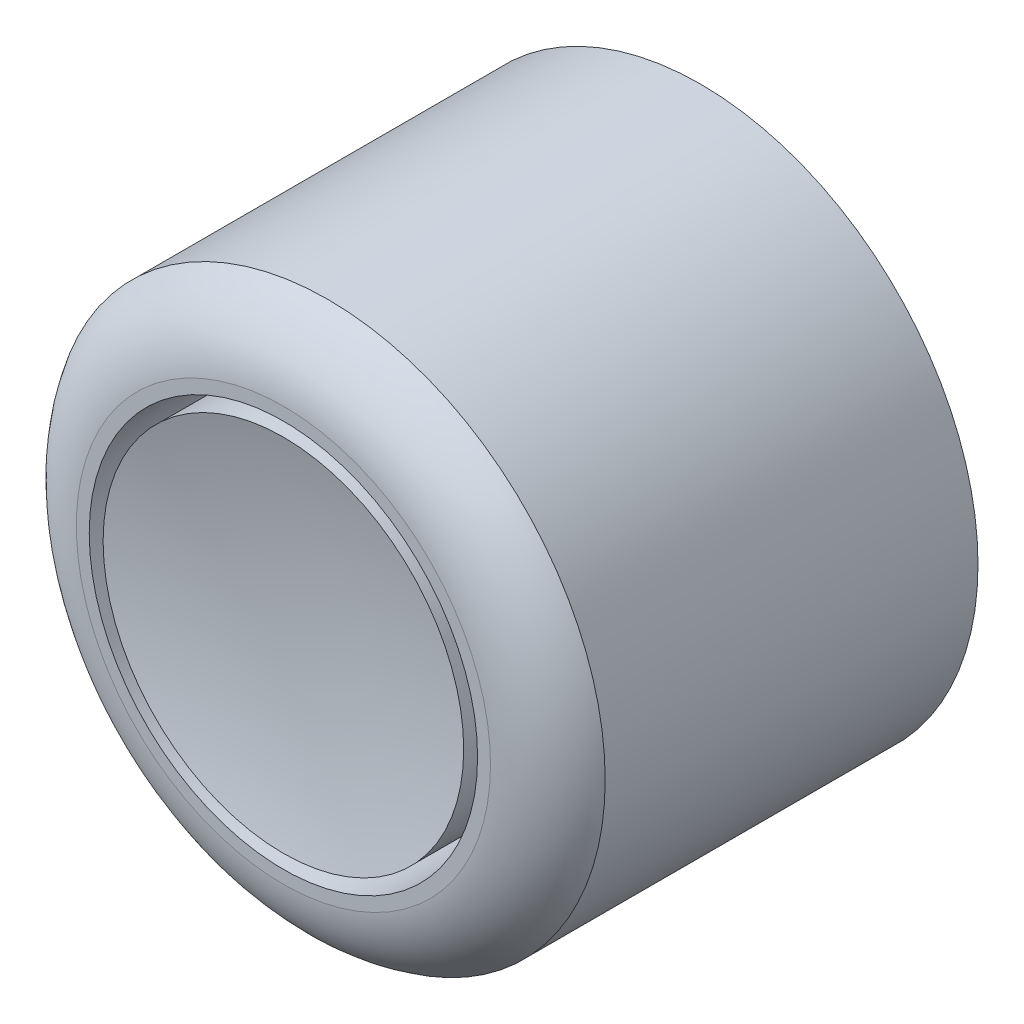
ISO-10303-21;
HEADER;
FILE_DESCRIPTION(('STEP AP214'),'2;1');
FILE_NAME('part.step','',(''),(''),'','','');
FILE_SCHEMA(('AUTOMOTIVE_DESIGN { 1 0 10303 214 1 1 1 1 }'));
ENDSEC;
DATA;
#1=APPLICATION_CONTEXT('core data for automotive mechanical design processes');
#2=APPLICATION_PROTOCOL_DEFINITION('international standard','automotive_design',2000,#1);
#3=PRODUCT_CONTEXT('',#1,'mechanical');
#4=PRODUCT('Part','Part','',(#3));
#5=PRODUCT_RELATED_PRODUCT_CATEGORY('part','',(#4));
#6=PRODUCT_DEFINITION_FORMATION('','',#4);
#7=PRODUCT_DEFINITION_CONTEXT('part definition',#1,'design');
#8=PRODUCT_DEFINITION('design','',#6,#7);
#9=PRODUCT_DEFINITION_SHAPE('','',#8);
#10=(LENGTH_UNIT() NAMED_UNIT(*) SI_UNIT(.MILLI.,.METRE.));
#11=(NAMED_UNIT(*) PLANE_ANGLE_UNIT() SI_UNIT($,.RADIAN.));
#12=(NAMED_UNIT(*) SI_UNIT($,.STERADIAN.) SOLID_ANGLE_UNIT());
#13=UNCERTAINTY_MEASURE_WITH_UNIT(LENGTH_MEASURE(1.E-05),#10,'distance_accuracy_value','');
#14=(GEOMETRIC_REPRESENTATION_CONTEXT(3) GLOBAL_UNCERTAINTY_ASSIGNED_CONTEXT((#13)) GLOBAL_UNIT_ASSIGNED_CONTEXT((#10,
#11,#12)) REPRESENTATION_CONTEXT('',''));
#15=CARTESIAN_POINT('',(0.,0.,0.));
#16=DIRECTION('',(0.,0.,1.));
#17=DIRECTION('',(1.,0.,0.));
#18=AXIS2_PLACEMENT_3D('',#15,#16,#17);
#19=CARTESIAN_POINT('',(0.,0.,-5.04293524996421));
#20=DIRECTION('',(0.,0.,1.));
#21=DIRECTION('',(1.,0.,0.));
#22=AXIS2_PLACEMENT_3D('',#19,#20,#21);
#23=TOROIDAL_SURFACE('',#22,11.4815178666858,5.05641870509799);
#24=CARTESIAN_POINT('',(0.,0.,-2.54));
#25=DIRECTION('',(0.,0.,1.));
#26=DIRECTION('',(1.,0.,0.));
#27=AXIS2_PLACEMENT_3D('',#24,#25,#26);
#28=CIRCLE('',#27,15.875);
#29=CARTESIAN_POINT('',(15.875,0.,-2.54));
#30=VERTEX_POINT('',#29);
#31=EDGE_CURVE('E55',#30,#30,#28,.T.);
#32=ORIENTED_EDGE('',*,*,#31,.T.);
#33=EDGE_LOOP('',(#32));
#34=FACE_BOUND('',#33,.T.);
#35=CARTESIAN_POINT('',(0.,0.,0.));
#36=DIRECTION('',(0.,0.,1.));
#37=DIRECTION('',(1.,0.,0.));
#38=AXIS2_PLACEMENT_3D('',#35,#36,#37);
#39=CIRCLE('',#38,11.8505357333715);
#40=CARTESIAN_POINT('',(11.8505357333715,0.,0.));
#41=VERTEX_POINT('',#40);
#42=EDGE_CURVE('E10',#41,#41,#39,.T.);
#43=ORIENTED_EDGE('',*,*,#42,.F.);
#44=EDGE_LOOP('',(#43));
#45=FACE_BOUND('',#44,.T.);
#46=ADVANCED_FACE('F30',(#34,#45),#23,.T.);
#47=CARTESIAN_POINT('',(0.,0.,0.));
#48=DIRECTION('',(0.,0.,-1.));
#49=DIRECTION('',(-1.,0.,0.));
#50=AXIS2_PLACEMENT_3D('',#47,#48,#49);
#51=PLANE('',#50);
#52=CARTESIAN_POINT('',(0.,0.,0.));
#53=DIRECTION('',(0.,0.,1.));
#54=DIRECTION('',(1.,0.,0.));
#55=AXIS2_PLACEMENT_3D('',#52,#53,#54);
#56=CIRCLE('',#55,11.1125);
#57=CARTESIAN_POINT('',(11.1125,0.,0.));
#58=VERTEX_POINT('',#57);
#59=EDGE_CURVE('E36',#58,#58,#56,.T.);
#60=ORIENTED_EDGE('',*,*,#59,.F.);
#61=EDGE_LOOP('',(#60));
#62=FACE_BOUND('',#61,.T.);
#63=ORIENTED_EDGE('',*,*,#42,.T.);
#64=EDGE_LOOP('',(#63));
#65=FACE_BOUND('',#64,.T.);
#66=ADVANCED_FACE('F78',(#62,#65),#51,.F.);
#67=CARTESIAN_POINT('',(0.,0.,0.));
#68=DIRECTION('',(0.,0.,1.));
#69=DIRECTION('',(1.,0.,0.));
#70=AXIS2_PLACEMENT_3D('',#67,#68,#69);
#71=CYLINDRICAL_SURFACE('',#70,11.1125);
#72=CARTESIAN_POINT('',(0.,0.,-12.7));
#73=DIRECTION('',(0.,0.,1.));
#74=DIRECTION('',(1.,0.,0.));
#75=AXIS2_PLACEMENT_3D('',#72,#73,#74);
#76=CIRCLE('',#75,11.1125);
#77=CARTESIAN_POINT('',(11.1125,0.,-12.7));
#78=VERTEX_POINT('',#77);
#79=EDGE_CURVE('E40',#78,#78,#76,.T.);
#80=ORIENTED_EDGE('',*,*,#79,.F.);
#81=EDGE_LOOP('',(#80));
#82=FACE_BOUND('',#81,.T.);
#83=ORIENTED_EDGE('',*,*,#59,.T.);
#84=EDGE_LOOP('',(#83));
#85=FACE_BOUND('',#84,.T.);
#86=ADVANCED_FACE('F82',(#82,#85),#71,.F.);
#87=CARTESIAN_POINT('',(0.,0.,-12.7));
#88=DIRECTION('',(0.,0.,-1.));
#89=DIRECTION('',(-1.,0.,0.));
#90=AXIS2_PLACEMENT_3D('',#87,#88,#89);
#91=PLANE('',#90);
#92=CARTESIAN_POINT('',(0.,0.,-12.7));
#93=DIRECTION('',(0.,0.,1.));
#94=DIRECTION('',(1.,0.,0.));
#95=AXIS2_PLACEMENT_3D('',#92,#93,#94);
#96=CIRCLE('',#95,10.31875);
#97=CARTESIAN_POINT('',(10.31875,0.,-12.7));
#98=VERTEX_POINT('',#97);
#99=EDGE_CURVE('E44',#98,#98,#96,.T.);
#100=ORIENTED_EDGE('',*,*,#99,.F.);
#101=EDGE_LOOP('',(#100));
#102=FACE_BOUND('',#101,.T.);
#103=ORIENTED_EDGE('',*,*,#79,.T.);
#104=EDGE_LOOP('',(#103));
#105=FACE_BOUND('',#104,.T.);
#106=ADVANCED_FACE('F87',(#102,#105),#91,.F.);
#107=CARTESIAN_POINT('',(0.,0.,0.));
#108=DIRECTION('',(0.,0.,1.));
#109=DIRECTION('',(1.,0.,0.));
#110=AXIS2_PLACEMENT_3D('',#107,#108,#109);
#111=CYLINDRICAL_SURFACE('',#110,10.31875);
#112=CARTESIAN_POINT('',(0.,0.,0.));
#113=DIRECTION('',(0.,0.,1.));
#114=DIRECTION('',(1.,0.,0.));
#115=AXIS2_PLACEMENT_3D('',#112,#113,#114);
#116=CIRCLE('',#115,10.31875);
#117=CARTESIAN_POINT('',(10.31875,0.,0.));
#118=VERTEX_POINT('',#117);
#119=EDGE_CURVE('E49',#118,#118,#116,.T.);
#120=ORIENTED_EDGE('',*,*,#119,.F.);
#121=EDGE_LOOP('',(#120));
#122=FACE_BOUND('',#121,.T.);
#123=ORIENTED_EDGE('',*,*,#99,.T.);
#124=EDGE_LOOP('',(#123));
#125=FACE_BOUND('',#124,.T.);
#126=ADVANCED_FACE('F74',(#122,#125),#111,.T.);
#127=CARTESIAN_POINT('',(0.,0.,41.284921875));
#128=DIRECTION('',(0.,0.,1.));
#129=DIRECTION('',(0.,1.,0.));
#130=AXIS2_PLACEMENT_3D('',#127,#128,#129);
#131=SPHERICAL_SURFACE('',#130,42.554921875);
#132=ORIENTED_EDGE('',*,*,#119,.T.);
#133=EDGE_LOOP('',(#132));
#134=FACE_BOUND('',#133,.T.);
#135=ADVANCED_FACE('F69',(#134),#131,.F.);
#136=CARTESIAN_POINT('',(0.,0.,-23.876));
#137=DIRECTION('',(0.,0.,1.));
#138=DIRECTION('',(1.,0.,0.));
#139=AXIS2_PLACEMENT_3D('',#136,#137,#138);
#140=PLANE('',#139);
#141=CARTESIAN_POINT('',(0.,0.,-23.876));
#142=DIRECTION('',(0.,0.,1.));
#143=DIRECTION('',(1.,0.,0.));
#144=AXIS2_PLACEMENT_3D('',#141,#142,#143);
#145=CIRCLE('',#144,15.875);
#146=CARTESIAN_POINT('',(15.875,0.,-23.876));
#147=VERTEX_POINT('',#146);
#148=EDGE_CURVE('E52',#147,#147,#145,.T.);
#149=ORIENTED_EDGE('',*,*,#148,.F.);
#150=EDGE_LOOP('',(#149));
#151=FACE_BOUND('',#150,.T.);
#152=ADVANCED_FACE('F64',(#151),#140,.F.);
#153=CARTESIAN_POINT('',(0.,0.,0.));
#154=DIRECTION('',(0.,0.,1.));
#155=DIRECTION('',(1.,0.,0.));
#156=AXIS2_PLACEMENT_3D('',#153,#154,#155);
#157=CYLINDRICAL_SURFACE('',#156,15.875);
#158=ORIENTED_EDGE('',*,*,#31,.F.);
#159=EDGE_LOOP('',(#158));
#160=FACE_BOUND('',#159,.T.);
#161=ORIENTED_EDGE('',*,*,#148,.T.);
#162=EDGE_LOOP('',(#161));
#163=FACE_BOUND('',#162,.T.);
#164=ADVANCED_FACE('F61',(#160,#163),#157,.T.);
#165=CLOSED_SHELL('',(#46,#66,#86,#106,#126,#135,#152,#164));
#166=MANIFOLD_SOLID_BREP('B2',#165);
#167=ADVANCED_BREP_SHAPE_REPRESENTATION('',(#18,#166),#14);
#168=SHAPE_DEFINITION_REPRESENTATION(#9,#167);
ENDSEC;
END-ISO-10303-21;
